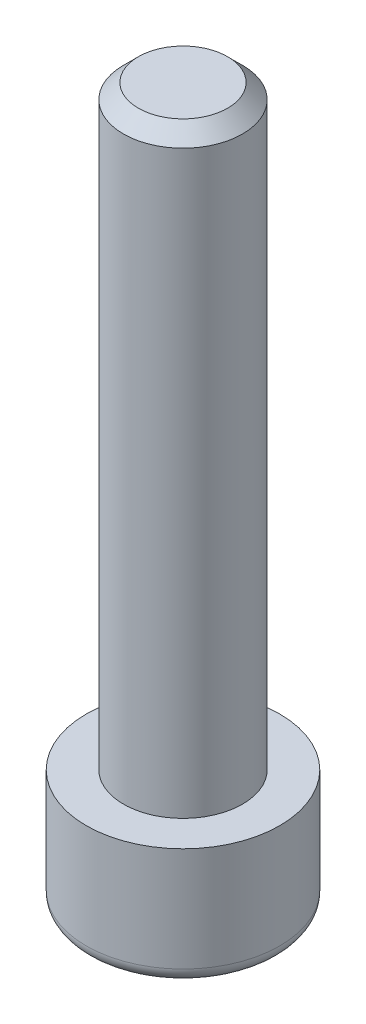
from build123d import *

# Parameters (mm, degrees)
ESQUISSE1_R             = 4
EXTRUSION1_DEPTH        = 40
CHANFREIN1_SIZE         = 1
ESQUISSE2_R             = 6.5
EXTRUSION2_DEPTH        = 8
CONG_1_R                = 1
ENL_V_MAT_EXTRU_1_DEPTH = 6


with BuildPart() as part:
    # Esquisse1 → Extrusion1 (new body)
    with BuildSketch(Plane(origin=(0, 0, 0), x_dir=(1, 0, 0), z_dir=(0, 1, 0))):
        with Locations(Location((0, 0, 0), (0, 0, 270))):
            Circle(ESQUISSE1_R)
    extrude(amount=EXTRUSION1_DEPTH)

    # Chanfrein1
    chanfrein1_edges = [part.edges().sort_by_distance(p)[0] for p in [
        (0, 40, -4),
    ]]
    chamfer(chanfrein1_edges, length=CHANFREIN1_SIZE)

    # Esquisse2 → Extrusion2 (add)
    with BuildSketch(Plane.XZ):
        with Locations(Location((0, 0, 0), (0, 0, 270))):
            Circle(ESQUISSE2_R)
    extrude(amount=EXTRUSION2_DEPTH)

    # Cong_1
    cong_1_edges = [part.edges().sort_by_distance(p)[0] for p in [
        (0, -8, 6.5),
    ]]
    fillet(cong_1_edges, radius=CONG_1_R)

    # Esquisse3 → Enl_v. mat.-Extru.1 (cut)
    with BuildSketch(Plane.XZ.offset(8)):
        Polygon((-3, 1.72923601), (0, 3.45), (3, 1.72923601), (3, -1.72923601), (0, -3.45), (-3, -1.72923601), align=None)
    extrude(amount=-ENL_V_MAT_EXTRU_1_DEPTH, mode=Mode.SUBTRACT)


solid = part.part
